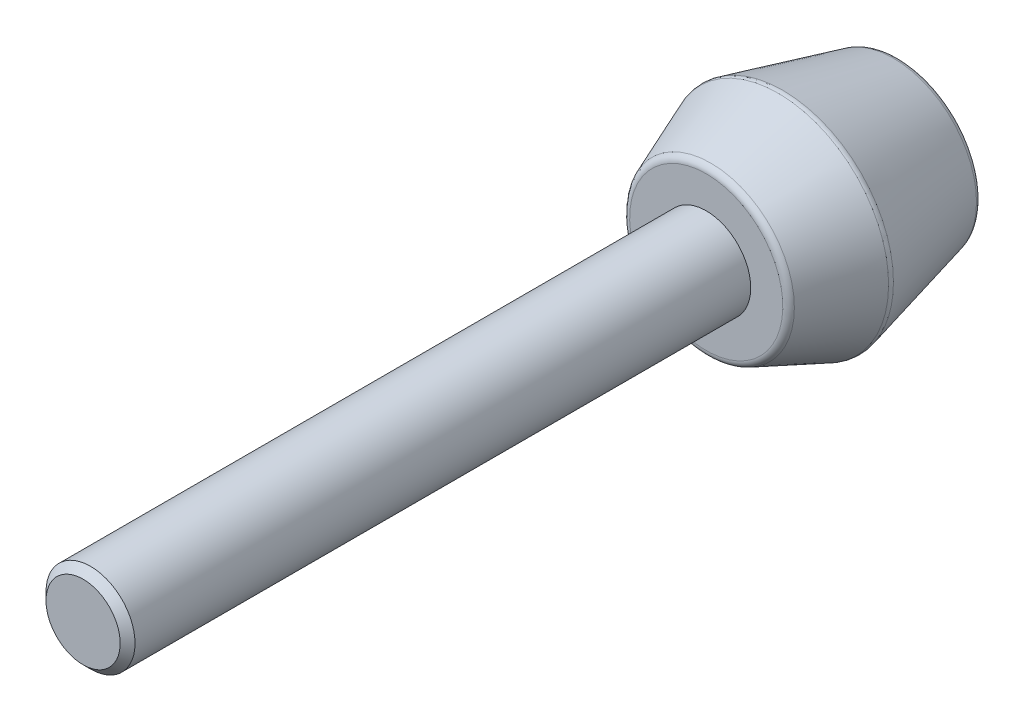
ISO-10303-21;
HEADER;
FILE_DESCRIPTION(('STEP AP214'),'2;1');
FILE_NAME('part.step','',(''),(''),'','','');
FILE_SCHEMA(('AUTOMOTIVE_DESIGN { 1 0 10303 214 1 1 1 1 }'));
ENDSEC;
DATA;
#1=APPLICATION_CONTEXT('core data for automotive mechanical design processes');
#2=APPLICATION_PROTOCOL_DEFINITION('international standard','automotive_design',2000,#1);
#3=PRODUCT_CONTEXT('',#1,'mechanical');
#4=PRODUCT('Part','Part','',(#3));
#5=PRODUCT_RELATED_PRODUCT_CATEGORY('part','',(#4));
#6=PRODUCT_DEFINITION_FORMATION('','',#4);
#7=PRODUCT_DEFINITION_CONTEXT('part definition',#1,'design');
#8=PRODUCT_DEFINITION('design','',#6,#7);
#9=PRODUCT_DEFINITION_SHAPE('','',#8);
#10=(LENGTH_UNIT() NAMED_UNIT(*) SI_UNIT(.MILLI.,.METRE.));
#11=(NAMED_UNIT(*) PLANE_ANGLE_UNIT() SI_UNIT($,.RADIAN.));
#12=(NAMED_UNIT(*) SI_UNIT($,.STERADIAN.) SOLID_ANGLE_UNIT());
#13=UNCERTAINTY_MEASURE_WITH_UNIT(LENGTH_MEASURE(1.E-05),#10,'distance_accuracy_value','');
#14=(GEOMETRIC_REPRESENTATION_CONTEXT(3) GLOBAL_UNCERTAINTY_ASSIGNED_CONTEXT((#13)) GLOBAL_UNIT_ASSIGNED_CONTEXT((#10,
#11,#12)) REPRESENTATION_CONTEXT('',''));
#15=CARTESIAN_POINT('',(0.,0.,0.));
#16=DIRECTION('',(0.,0.,1.));
#17=DIRECTION('',(1.,0.,0.));
#18=AXIS2_PLACEMENT_3D('',#15,#16,#17);
#19=CARTESIAN_POINT('',(0.,0.,0.));
#20=DIRECTION('',(0.,0.,-1.));
#21=DIRECTION('',(-1.,0.,0.));
#22=AXIS2_PLACEMENT_3D('',#19,#20,#21);
#23=PLANE('',#22);
#24=CARTESIAN_POINT('',(0.,0.,0.));
#25=DIRECTION('',(0.,0.,-1.));
#26=DIRECTION('',(-1.,0.,0.));
#27=AXIS2_PLACEMENT_3D('',#24,#25,#26);
#28=CIRCLE('',#27,5.10961179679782);
#29=CARTESIAN_POINT('',(-3.92983953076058,3.26565368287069,0.));
#30=VERTEX_POINT('',#29);
#31=CARTESIAN_POINT('',(3.9298395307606,-3.26565368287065,0.));
#32=VERTEX_POINT('',#31);
#33=EDGE_CURVE('E18',#30,#32,#28,.F.);
#34=ORIENTED_EDGE('',*,*,#33,.F.);
#35=CARTESIAN_POINT('',(3.9298395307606,-3.26565368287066,0.));
#36=CARTESIAN_POINT('',(3.96271365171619,-3.22607651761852,2.35537752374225E-12));
#37=CARTESIAN_POINT('',(3.99498994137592,-3.18600279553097,3.68134116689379E-10));
#38=CARTESIAN_POINT('',(4.05831812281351,-3.10489968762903,1.67353500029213E-09));
#39=CARTESIAN_POINT('',(4.08937002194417,-3.06387030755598,2.61315369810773E-09));
#40=CARTESIAN_POINT('',(4.15022091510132,-2.98089308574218,4.91320773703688E-09));
#41=CARTESIAN_POINT('',(4.180019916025,-2.93894524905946,6.27364076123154E-09));
#42=CARTESIAN_POINT('',(4.23833794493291,-2.8541693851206,9.27886281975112E-09));
#43=CARTESIAN_POINT('',(4.26685697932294,-2.81134136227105,1.09236504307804E-08));
#44=CARTESIAN_POINT('',(4.32258909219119,-2.72484413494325,1.43732504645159E-08));
#45=CARTESIAN_POINT('',(4.34980217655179,-2.68117493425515,1.6178062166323E-08));
#46=CARTESIAN_POINT('',(4.40289761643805,-2.59303514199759,1.98366967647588E-08));
#47=CARTESIAN_POINT('',(4.42877997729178,-2.54856455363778,2.16905194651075E-08));
#48=CARTESIAN_POINT('',(4.47919040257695,-2.45886250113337,2.53491622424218E-08));
#49=CARTESIAN_POINT('',(4.5037184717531,-2.4136310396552,2.71539824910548E-08));
#50=CARTESIAN_POINT('',(4.55139798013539,-2.32244844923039,3.06296909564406E-08));
#51=CARTESIAN_POINT('',(4.57454942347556,-2.27649732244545,3.23005795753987E-08));
#52=CARTESIAN_POINT('',(4.61945459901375,-2.18391726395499,3.54365577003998E-08));
#53=CARTESIAN_POINT('',(4.6412083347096,-2.13728833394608,3.69016477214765E-08));
#54=CARTESIAN_POINT('',(4.6832982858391,-2.0433951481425,3.95672290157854E-08));
#55=CARTESIAN_POINT('',(4.70363450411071,-1.99613089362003,4.07677208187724E-08));
#56=CARTESIAN_POINT('',(4.74287090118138,-1.90101011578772,4.28583728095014E-08));
#57=CARTESIAN_POINT('',(4.76177108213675,-1.85315359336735,4.37485334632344E-08));
#58=CARTESIAN_POINT('',(4.79811819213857,-1.75689187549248,4.51858567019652E-08));
#59=CARTESIAN_POINT('',(4.81556512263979,-1.70848668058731,4.57330196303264E-08));
#60=CARTESIAN_POINT('',(4.84898984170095,-1.61117171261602,4.64647478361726E-08));
#61=CARTESIAN_POINT('',(4.86496763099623,-1.56226193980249,4.66493132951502E-08));
#62=CARTESIAN_POINT('',(4.89543951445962,-1.46398236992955,4.66493133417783E-08));
#63=CARTESIAN_POINT('',(4.90993360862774,-1.41461257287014,4.64647479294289E-08));
#64=CARTESIAN_POINT('',(4.93742489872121,-1.31545792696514,4.57330197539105E-08));
#65=CARTESIAN_POINT('',(4.95042209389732,-1.2656730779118,4.5185856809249E-08));
#66=CARTESIAN_POINT('',(4.97490774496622,-1.16573367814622,4.3748533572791E-08));
#67=CARTESIAN_POINT('',(4.98639619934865,-1.11557912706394,4.2858372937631E-08));
#68=CARTESIAN_POINT('',(5.00785390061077,-1.01494600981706,4.07677209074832E-08));
#69=CARTESIAN_POINT('',(5.01782314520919,-0.964467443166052,3.95672290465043E-08));
#70=CARTESIAN_POINT('',(5.03623334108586,-0.863232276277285,3.69016479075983E-08));
#71=CARTESIAN_POINT('',(5.04467428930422,-0.812475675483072,3.54365580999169E-08));
#72=CARTESIAN_POINT('',(5.06002019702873,-0.710730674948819,3.23005793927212E-08));
#73=CARTESIAN_POINT('',(5.06692515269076,-0.659742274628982,3.06296899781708E-08));
#74=CARTESIAN_POINT('',(5.07919277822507,-0.557580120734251,2.71539836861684E-08));
#75=CARTESIAN_POINT('',(5.08455544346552,-0.506406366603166,2.53491664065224E-08));
#76=CARTESIAN_POINT('',(5.0937335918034,-0.403920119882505,2.16905155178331E-08));
#77=CARTESIAN_POINT('',(5.0975490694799,-0.352607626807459,1.98366817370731E-08));
#78=CARTESIAN_POINT('',(5.10362936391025,-0.249890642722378,1.61780771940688E-08));
#79=CARTESIAN_POINT('',(5.10589417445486,-0.198486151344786,1.43733066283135E-08));
#80=CARTESIAN_POINT('',(5.10887103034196,-0.0956319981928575,1.09235944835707E-08));
#81=CARTESIAN_POINT('',(5.10958306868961,-0.0441823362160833,9.27865362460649E-09));
#82=CARTESIAN_POINT('',(5.10945382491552,0.0587153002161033,6.27385017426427E-09));
#83=CARTESIAN_POINT('',(5.10861253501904,0.11016327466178,4.91398900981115E-09));
#84=CARTESIAN_POINT('',(5.1053769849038,0.213010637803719,2.612372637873E-09));
#85=CARTESIAN_POINT('',(5.10298271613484,0.26441002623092,1.67061973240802E-09));
#86=CARTESIAN_POINT('',(5.09664486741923,0.367113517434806,3.71049835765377E-10));
#87=CARTESIAN_POINT('',(5.09270127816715,0.418417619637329,1.3236351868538E-11));
#88=CARTESIAN_POINT('',(5.08325847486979,0.520930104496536,-1.32272578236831E-11));
#89=CARTESIAN_POINT('',(5.07775783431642,0.572138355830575,3.18756357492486E-10));
#90=CARTESIAN_POINT('',(5.06520196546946,0.674363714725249,5.87345769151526E-10));
#91=CARTESIAN_POINT('',(5.0581467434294,0.725380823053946,5.23953155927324E-10));
#92=CARTESIAN_POINT('',(5.04248972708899,0.827176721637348,1.69575433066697E-10));
#93=CARTESIAN_POINT('',(5.03388794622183,0.877955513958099,-1.21407699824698E-10));
#94=CARTESIAN_POINT('',(5.01514560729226,0.979227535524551,2.49117954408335E-10));
#95=CARTESIAN_POINT('',(5.00500506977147,1.02972076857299,9.10614027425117E-10));
#96=CARTESIAN_POINT('',(4.98319412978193,1.13037512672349,5.94561464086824E-09));
#97=CARTESIAN_POINT('',(4.97152375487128,1.18053625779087,1.03190523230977E-08));
#98=CARTESIAN_POINT('',(4.9466664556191,1.28047875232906,2.50898020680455E-08));
#99=CARTESIAN_POINT('',(4.93347956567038,1.33026012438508,3.54869775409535E-08));
#100=CARTESIAN_POINT('',(4.89961761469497,1.45064197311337,7.94713556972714E-08));
#101=CARTESIAN_POINT('',(4.87815501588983,1.52102371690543,1.21085945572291E-07));
#102=CARTESIAN_POINT('',(4.84602053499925,1.61883193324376,1.91165246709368E-07));
#103=CARTESIAN_POINT('',(4.83660605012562,1.6466794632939,2.12525625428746E-07));
#104=CARTESIAN_POINT('',(4.79319176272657,1.77161402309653,2.6845037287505E-07));
#105=CARTESIAN_POINT('',(4.75655245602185,1.86780485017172,2.02592038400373E-07));
#106=CARTESIAN_POINT('',(4.69469437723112,2.01716705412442,6.58482928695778E-08));
#107=CARTESIAN_POINT('',(4.67131018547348,2.0711087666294,9.21200799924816E-09));
#108=CARTESIAN_POINT('',(4.63968805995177,2.1404988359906,-2.15080641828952E-09));
#109=CARTESIAN_POINT('',(4.63235397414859,2.15636009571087,-5.23429723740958E-10));
#110=CARTESIAN_POINT('',(4.5813574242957,2.26512198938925,7.83807498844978E-09));
#111=CARTESIAN_POINT('',(4.53485630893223,2.35671831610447,8.03291034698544E-10));
#112=CARTESIAN_POINT('',(4.45186327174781,2.50872263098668,-5.1927746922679E-10));
#113=CARTESIAN_POINT('',(4.416794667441,2.56991824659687,1.89208759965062E-09));
#114=CARTESIAN_POINT('',(4.3501782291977,2.68077077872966,9.67465717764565E-09));
#115=CARTESIAN_POINT('',(4.31901234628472,2.7306567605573,1.44880583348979E-08));
#116=CARTESIAN_POINT('',(4.25898615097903,2.82315918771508,2.38089493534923E-08));
#117=CARTESIAN_POINT('',(4.23032460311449,2.86590486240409,2.82794697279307E-08));
#118=CARTESIAN_POINT('',(4.17172609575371,2.95051289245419,3.65504858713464E-08));
#119=CARTESIAN_POINT('',(4.14178914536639,2.9923752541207,4.03509864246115E-08));
#120=CARTESIAN_POINT('',(4.08066777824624,3.07517872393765,4.65743599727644E-08));
#121=CARTESIAN_POINT('',(4.04948336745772,3.1161198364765,4.8997239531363E-08));
#122=CARTESIAN_POINT('',(3.98589511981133,3.1970437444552,5.20750425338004E-08));
#123=CARTESIAN_POINT('',(3.95349128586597,3.23702654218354,5.27299702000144E-08));
#124=CARTESIAN_POINT('',(3.88749360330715,3.31599760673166,5.21683787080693E-08));
#125=CARTESIAN_POINT('',(3.85389975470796,3.35498587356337,5.09518595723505E-08));
#126=CARTESIAN_POINT('',(3.7855524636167,3.43193257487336,4.68391051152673E-08));
#127=CARTESIAN_POINT('',(3.75079901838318,3.46989100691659,4.39428658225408E-08));
#128=CARTESIAN_POINT('',(3.68016397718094,3.54474361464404,3.69545109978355E-08));
#129=CARTESIAN_POINT('',(3.6442823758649,3.58163778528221,3.28623897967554E-08));
#130=CARTESIAN_POINT('',(3.5714236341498,3.65432859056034,2.42622741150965E-08));
#131=CARTESIAN_POINT('',(3.53444648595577,3.69012521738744,1.97542766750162E-08));
#132=CARTESIAN_POINT('',(3.45942966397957,3.76058795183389,1.1385458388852E-08));
#133=CARTESIAN_POINT('',(3.42138998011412,3.79525404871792,7.52464368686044E-09));
#134=CARTESIAN_POINT('',(3.34428424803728,3.86342634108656,1.84468683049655E-09));
#135=CARTESIAN_POINT('',(3.30521818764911,3.89693252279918,2.55689096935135E-11));
#136=CARTESIAN_POINT('',(3.22606100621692,3.96276997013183,-2.55662919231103E-11));
#137=CARTESIAN_POINT('',(3.18596917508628,3.99510038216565,1.74497154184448E-09));
#138=CARTESIAN_POINT('',(3.10481816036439,4.05852341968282,4.75745464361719E-09));
#139=CARTESIAN_POINT('',(3.06375897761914,4.08961604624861,5.99940037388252E-09));
#140=CARTESIAN_POINT('',(2.98071328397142,4.15053650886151,6.47409573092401E-09));
#141=CARTESIAN_POINT('',(2.93872678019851,4.18036435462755,5.70686079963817E-09));
#142=CARTESIAN_POINT('',(2.85386545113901,4.23872694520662,2.96854866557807E-09));
#143=CARTESIAN_POINT('',(2.81099063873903,4.26726170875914,9.97488914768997E-10));
#144=CARTESIAN_POINT('',(2.72439219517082,4.32301131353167,-3.72037772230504E-10));
#145=CARTESIAN_POINT('',(2.68066858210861,4.35022618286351,2.29440475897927E-10));
#146=CARTESIAN_POINT('',(2.59241611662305,4.40331188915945,8.36659364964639E-09));
#147=CARTESIAN_POINT('',(2.547887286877,4.42918276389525,1.5902073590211E-08));
#148=CARTESIAN_POINT('',(2.43880988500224,4.49034291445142,5.93847922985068E-08));
#149=CARTESIAN_POINT('',(2.37385801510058,4.52491838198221,1.06121802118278E-07));
#150=CARTESIAN_POINT('',(2.28196340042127,4.57133497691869,1.9714607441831E-07));
#151=CARTESIAN_POINT('',(2.25561169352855,4.58436303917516,2.26059278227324E-07));
#152=CARTESIAN_POINT('',(2.13655930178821,4.64198235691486,3.08030373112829E-07));
#153=CARTESIAN_POINT('',(2.04263184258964,4.68408315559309,2.40839121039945E-07));
#154=CARTESIAN_POINT('',(1.89328763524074,4.74598200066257,8.05492123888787E-08));
#155=CARTESIAN_POINT('',(1.83861740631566,4.76760585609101,1.08932445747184E-08));
#156=CARTESIAN_POINT('',(1.76781275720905,4.79408616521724,-2.53335771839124E-09));
#157=CARTESIAN_POINT('',(1.7520323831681,4.7998915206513,-6.74416015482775E-10));
#158=CARTESIAN_POINT('',(1.63970442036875,4.8405604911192,9.33485939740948E-09));
#159=CARTESIAN_POINT('',(1.54206630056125,4.87248301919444,1.161027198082E-09));
#160=CARTESIAN_POINT('',(1.37528271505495,4.92153089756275,-7.82896983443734E-10));
#161=CARTESIAN_POINT('',(1.30657957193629,4.94019225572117,1.79924165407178E-09));
#162=CARTESIAN_POINT('',(1.18044932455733,4.97163181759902,9.71853858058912E-09));
#163=CARTESIAN_POINT('',(1.12313700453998,4.98486885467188,1.44990852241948E-08));
#164=CARTESIAN_POINT('',(1.01528298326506,5.00783297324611,2.37993008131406E-08));
#165=CARTESIAN_POINT('',(0.964790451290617,5.0177919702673,2.82768844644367E-08));
#166=CARTESIAN_POINT('',(0.863528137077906,5.03618349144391,3.6553072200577E-08));
#167=CARTESIAN_POINT('',(0.812758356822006,5.04461602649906,4.03516811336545E-08));
#168=CARTESIAN_POINT('',(0.710988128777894,5.05994758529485,4.657366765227E-08));
#169=CARTESIAN_POINT('',(0.659987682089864,5.06684661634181,4.89970517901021E-08));
#170=CARTESIAN_POINT('',(0.557802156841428,5.079104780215,5.20752333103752E-08));
#171=CARTESIAN_POINT('',(0.506617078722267,5.08446391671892,5.27300349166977E-08));
#172=CARTESIAN_POINT('',(0.404108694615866,5.09363748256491,5.21683174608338E-08));
#173=CARTESIAN_POINT('',(0.352785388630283,5.0974519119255,5.09517984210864E-08));
#174=CARTESIAN_POINT('',(0.250047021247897,5.10353261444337,4.68391693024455E-08));
#175=CARTESIAN_POINT('',(0.198631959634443,5.1057988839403,4.39430552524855E-08));
#176=CARTESIAN_POINT('',(0.0957566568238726,5.10878114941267,3.6954323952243E-08));
#177=CARTESIAN_POINT('',(0.0442964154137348,5.10949713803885,3.28617010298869E-08));
#178=CARTESIAN_POINT('',(-0.058622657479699,5.10937840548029,2.42629644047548E-08));
#179=CARTESIAN_POINT('',(-0.110081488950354,5.10854367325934,1.97568477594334E-08));
#180=CARTESIAN_POINT('',(-0.212951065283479,5.10532338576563,1.13828877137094E-08));
#181=CARTESIAN_POINT('',(-0.264361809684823,5.10293781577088,7.51505037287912E-09));
#182=CARTESIAN_POINT('',(-0.367088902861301,5.09662114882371,1.85427982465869E-09));
#183=CARTESIAN_POINT('',(-0.418405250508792,5.09269003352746,6.13712452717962E-11));
#184=CARTESIAN_POINT('',(-0.520887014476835,5.08327482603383,-6.13412747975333E-11));
#185=CARTESIAN_POINT('',(-0.572052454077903,5.07779098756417,1.60828925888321E-09));
#186=CARTESIAN_POINT('',(-0.674191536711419,5.06526310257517,3.87066400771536E-09));
#187=CARTESIAN_POINT('',(-0.725165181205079,5.05821906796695,4.46341644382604E-09));
#188=CARTESIAN_POINT('',(-0.826873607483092,5.04258163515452,2.82944585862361E-09));
#189=CARTESIAN_POINT('',(-0.877608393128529,5.03398826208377,6.02768570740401E-10));
#190=CARTESIAN_POINT('',(-0.978789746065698,5.0152556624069,5.62419884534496E-10));
#191=CARTESIAN_POINT('',(-1.02923632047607,5.00511647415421,2.74863901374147E-09));
#192=CARTESIAN_POINT('',(-1.14236876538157,4.98059153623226,3.72296394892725E-09));
#193=CARTESIAN_POINT('',(-1.20496252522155,4.96577778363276,1.52524049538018E-09));
#194=CARTESIAN_POINT('',(-1.32951824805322,4.93371568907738,9.47223061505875E-08));
#195=CARTESIAN_POINT('',(-1.39148024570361,4.91646748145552,1.9011171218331E-07));
#196=CARTESIAN_POINT('',(-1.49240301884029,4.88649085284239,2.12684619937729E-07));
#197=CARTESIAN_POINT('',(-1.53155292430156,4.87439294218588,1.88337872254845E-07));
#198=CARTESIAN_POINT('',(-1.62074553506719,4.84564619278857,1.38602639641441E-07));
#199=CARTESIAN_POINT('',(-1.67068894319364,4.82868789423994,1.14921478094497E-07));
#200=CARTESIAN_POINT('',(-1.79004333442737,4.78609893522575,6.28710859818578E-08));
#201=CARTESIAN_POINT('',(-1.85919123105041,4.75972683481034,3.64566993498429E-08));
#202=CARTESIAN_POINT('',(-1.98313292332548,4.70933465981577,8.83351110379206E-09));
#203=CARTESIAN_POINT('',(-2.03813811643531,4.68583232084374,3.76452166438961E-09));
#204=CARTESIAN_POINT('',(-2.14525283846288,4.63780131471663,-5.74745807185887E-10));
#205=CARTESIAN_POINT('',(-2.19739399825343,4.61334327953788,-5.35826590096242E-11));
#206=CARTESIAN_POINT('',(-2.29338669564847,4.56629655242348,1.55458514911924E-10));
#207=CARTESIAN_POINT('',(-2.33735391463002,4.54394339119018,-4.7800982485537E-11));
#208=CARTESIAN_POINT('',(-2.42669780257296,4.49687183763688,5.00974894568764E-11));
#209=CARTESIAN_POINT('',(-2.47204185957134,4.47209150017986,3.7574184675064E-10));
#210=CARTESIAN_POINT('',(-2.56192766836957,4.42118875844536,1.48825062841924E-09));
#211=CARTESIAN_POINT('',(-2.60646996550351,4.39506731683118,2.27478832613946E-09));
#212=CARTESIAN_POINT('',(-2.69471172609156,4.34150612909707,3.99096848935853E-09));
#213=CARTESIAN_POINT('',(-2.73841176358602,4.31406732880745,4.92050930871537E-09));
#214=CARTESIAN_POINT('',(-2.82493114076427,4.25790015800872,6.73116380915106E-09));
#215=CARTESIAN_POINT('',(-2.86775108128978,4.22917271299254,7.61231126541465E-09));
#216=CARTESIAN_POINT('',(-2.95247287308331,4.17045703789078,9.1664622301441E-09));
#217=CARTESIAN_POINT('',(-2.99437535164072,4.14046971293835,9.8396123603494E-09));
#218=CARTESIAN_POINT('',(-3.07722592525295,4.07926439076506,1.08752307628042E-08));
#219=CARTESIAN_POINT('',(-3.11817467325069,4.04804727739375,1.12379180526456E-08));
#220=CARTESIAN_POINT('',(-3.19908245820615,3.98441343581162,1.16004695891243E-08));
#221=CARTESIAN_POINT('',(-3.23904217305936,3.95199756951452,1.16005896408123E-08));
#222=CARTESIAN_POINT('',(-3.31793760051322,3.88599828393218,1.12380537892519E-08));
#223=CARTESIAN_POINT('',(-3.35687401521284,3.85241570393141,1.0875653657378E-08));
#224=CARTESIAN_POINT('',(-3.43368960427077,3.78411599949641,9.83991995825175E-09));
#225=CARTESIAN_POINT('',(-3.47156950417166,3.74939969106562,9.16680563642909E-09));
#226=CARTESIAN_POINT('',(-3.54623990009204,3.67886645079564,7.61306401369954E-09));
#227=CARTESIAN_POINT('',(-3.58303114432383,3.64305031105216,6.73258314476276E-09));
#228=CARTESIAN_POINT('',(-3.65549318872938,3.57035222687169,4.92036779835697E-09));
#229=CARTESIAN_POINT('',(-3.69116475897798,3.53347105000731,3.98866981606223E-09));
#230=CARTESIAN_POINT('',(-3.76135746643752,3.45867848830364,2.27829558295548E-09));
#231=CARTESIAN_POINT('',(-3.79587939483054,3.42076784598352,1.4995122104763E-09));
#232=CARTESIAN_POINT('',(-3.86374425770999,3.34395300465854,3.65272612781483E-10));
#233=CARTESIAN_POINT('',(-3.89708800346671,3.30504952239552,9.51936072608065E-12));
#234=CARTESIAN_POINT('',(-3.9298395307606,3.26565368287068,0.));
#235=B_SPLINE_CURVE_WITH_KNOTS('',3,(#35,#36,#37,#38,#39,#40,#41,#42,#43,#44,#45,#46,#47,#48,
#49,#50,#51,#52,#53,#54,#55,#56,#57,#58,#59,#60,#61,#62,#63,#64,#65,#66,#67,#68,#69,#70,#71,#72,
#73,#74,#75,#76,#77,#78,#79,#80,#81,#82,#83,#84,#85,#86,#87,#88,#89,#90,#91,#92,#93,#94,#95,#96,
#97,#98,#99,#100,#101,#102,#103,#104,#105,#106,#107,#108,#109,#110,#111,#112,#113,#114,#115,
#116,#117,#118,#119,#120,#121,#122,#123,#124,#125,#126,#127,#128,#129,#130,#131,#132,#133,#134,
#135,#136,#137,#138,#139,#140,#141,#142,#143,#144,#145,#146,#147,#148,#149,#150,#151,#152,#153,
#154,#155,#156,#157,#158,#159,#160,#161,#162,#163,#164,#165,#166,#167,#168,#169,#170,#171,#172,
#173,#174,#175,#176,#177,#178,#179,#180,#181,#182,#183,#184,#185,#186,#187,#188,#189,#190,#191,
#192,#193,#194,#195,#196,#197,#198,#199,#200,#201,#202,#203,#204,#205,#206,#207,#208,#209,#210,
#211,#212,#213,#214,#215,#216,#217,#218,#219,#220,#221,#222,#223,#224,#225,#226,#227,#228,#229,
#230,#231,#232,#233,#234),.UNSPECIFIED.,.F.,.F.,(4,2,2,2,2,2,2,2,2,2,2,2,2,2,2,2,2,2,2,2,2,2,2,
2,2,2,2,2,2,2,2,2,2,2,2,2,2,2,2,2,2,2,2,2,2,2,2,2,2,2,2,2,2,2,2,2,2,2,2,2,2,2,2,2,2,2,2,2,2,2,2,
2,2,2,2,2,2,2,2,2,2,2,2,2,2,2,2,2,2,2,2,2,2,2,2,2,2,2,2,4),(0.,0.154342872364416,
0.308684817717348,0.463025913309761,0.617366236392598,0.771705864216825,0.92604487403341,
1.0803833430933,1.23472134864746,1.38905896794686,1.54339627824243,1.69773335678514,
1.85207028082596,2.00640712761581,2.16074397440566,2.31508089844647,2.46941797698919,
2.62375528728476,2.77809290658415,2.93243091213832,3.08676938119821,3.24110839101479,
3.39544801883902,3.54978834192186,3.70412943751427,3.8584713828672,4.01281425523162,
4.16729899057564,4.32178310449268,4.47626587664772,4.63074658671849,4.78522451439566,
4.93969893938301,5.16036034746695,5.24854692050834,5.55713425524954,5.73347872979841,
5.78590288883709,6.09383976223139,6.30538389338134,6.48181043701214,6.6361838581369,
6.79055617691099,6.94492776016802,7.0992989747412,7.25367018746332,7.40804176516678,
7.56241407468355,7.7167874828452,7.87116235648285,8.02553906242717,8.1800256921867,
8.33451218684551,8.48899749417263,8.64348056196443,8.79796033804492,8.95243577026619,
9.17309645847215,9.26128430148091,9.56987094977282,9.74621258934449,9.79665544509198,
10.1045923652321,10.3181174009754,10.4945439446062,10.6489173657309,10.803289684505,
10.9576612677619,11.112032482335,11.2664036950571,11.4207752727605,11.5751475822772,
11.7295209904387,11.8838958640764,12.0382725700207,12.1926240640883,12.3469743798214,
12.5013221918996,12.6556661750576,12.8485845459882,13.0414922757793,13.1644127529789,
13.3226198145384,13.5445634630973,13.7239755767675,13.8967181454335,14.0446676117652,
14.1996638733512,14.3545503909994,14.5093273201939,14.6639948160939,14.8185530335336,
14.9730021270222,15.127342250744,15.2815735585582,15.4356962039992,15.5897103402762,
15.7436161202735,15.8974136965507,16.051103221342),.UNSPECIFIED.);
#236=EDGE_CURVE('E30',#32,#30,#235,.T.);
#237=ORIENTED_EDGE('',*,*,#236,.F.);
#238=EDGE_LOOP('',(#34,#237));
#239=FACE_BOUND('',#238,.T.);
#240=ADVANCED_FACE('F14',(#239),#23,.T.);
#241=CARTESIAN_POINT('',(0.,0.,0.500000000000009));
#242=DIRECTION('',(0.,0.,-1.));
#243=DIRECTION('',(-1.,0.,0.));
#244=AXIS2_PLACEMENT_3D('',#241,#242,#243);
#245=TOROIDAL_SURFACE('',#244,5.10961179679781,0.5);
#246=ORIENTED_EDGE('',*,*,#236,.T.);
#247=ORIENTED_EDGE('',*,*,#33,.T.);
#248=EDGE_LOOP('',(#246,#247));
#249=FACE_BOUND('',#248,.T.);
#250=CARTESIAN_POINT('',(0.,0.,0.378732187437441));
#251=DIRECTION('',(0.,0.,1.));
#252=DIRECTION('',(-0.7691072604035,0.639119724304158,0.));
#253=AXIS2_PLACEMENT_3D('',#250,#251,#252);
#254=CIRCLE('',#253,5.5946830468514);
#255=CARTESIAN_POINT('',(-4.30291135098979,3.57567228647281,0.37873218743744));
#256=VERTEX_POINT('',#255);
#257=EDGE_CURVE('E36',#256,#256,#254,.T.);
#258=ORIENTED_EDGE('',*,*,#257,.F.);
#259=EDGE_LOOP('',(#258));
#260=FACE_BOUND('',#259,.T.);
#261=ADVANCED_FACE('F33',(#249,#260),#245,.T.);
#262=CARTESIAN_POINT('',(0.,0.,7.84315022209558));
#263=DIRECTION('',(0.,0.,1.));
#264=DIRECTION('',(1.,0.,0.));
#265=AXIS2_PLACEMENT_3D('',#262,#263,#264);
#266=CONICAL_SURFACE('',#265,7.46078755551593,0.244978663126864);
#267=CARTESIAN_POINT('',(0.,0.,7.84315022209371));
#268=DIRECTION('',(0.,0.,1.));
#269=DIRECTION('',(1.,0.,0.));
#270=AXIS2_PLACEMENT_3D('',#267,#268,#269);
#271=CIRCLE('',#270,7.46078755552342);
#272=CARTESIAN_POINT('',(7.46078755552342,0.,7.84315022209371));
#273=VERTEX_POINT('',#272);
#274=EDGE_CURVE('E38',#273,#273,#271,.T.);
#275=ORIENTED_EDGE('',*,*,#274,.F.);
#276=EDGE_LOOP('',(#275));
#277=FACE_BOUND('',#276,.T.);
#278=ORIENTED_EDGE('',*,*,#257,.T.);
#279=EDGE_LOOP('',(#278));
#280=FACE_BOUND('',#279,.T.);
#281=ADVANCED_FACE('F60',(#277,#280),#266,.T.);
#282=CARTESIAN_POINT('',(0.,0.,7.96441803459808));
#283=DIRECTION('',(0.,0.,-1.));
#284=DIRECTION('',(-1.,0.,0.));
#285=AXIS2_PLACEMENT_3D('',#282,#283,#284);
#286=TOROIDAL_SURFACE('',#285,6.97571630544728,0.500000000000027);
#287=ORIENTED_EDGE('',*,*,#274,.T.);
#288=EDGE_LOOP('',(#287));
#289=FACE_BOUND('',#288,.T.);
#290=CARTESIAN_POINT('',(0.,0.,8.15011337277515));
#291=DIRECTION('',(0.,0.,-1.));
#292=DIRECTION('',(0.7691072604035,-0.639119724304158,0.));
#293=AXIS2_PLACEMENT_3D('',#290,#291,#292);
#294=CIRCLE('',#293,7.43995465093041);
#295=CARTESIAN_POINT('',(5.72212313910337,-4.75502176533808,8.15011337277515));
#296=VERTEX_POINT('',#295);
#297=EDGE_CURVE('E43',#296,#296,#294,.F.);
#298=ORIENTED_EDGE('',*,*,#297,.F.);
#299=EDGE_LOOP('',(#298));
#300=FACE_BOUND('',#299,.T.);
#301=ADVANCED_FACE('F61',(#289,#300),#286,.T.);
#302=CARTESIAN_POINT('',(0.,0.,8.15011337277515));
#303=DIRECTION('',(0.,0.,-1.));
#304=DIRECTION('',(-1.,0.,0.));
#305=AXIS2_PLACEMENT_3D('',#302,#303,#304);
#306=CONICAL_SURFACE('',#305,7.43995465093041,0.380506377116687);
#307=ORIENTED_EDGE('',*,*,#297,.T.);
#308=EDGE_LOOP('',(#307));
#309=FACE_BOUND('',#308,.T.);
#310=CARTESIAN_POINT('',(0.,0.,12.6856953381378));
#311=DIRECTION('',(0.,0.,1.));
#312=DIRECTION('',(0.,-1.,0.));
#313=AXIS2_PLACEMENT_3D('',#310,#311,#312);
#314=CIRCLE('',#313,5.62572186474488);
#315=CARTESIAN_POINT('',(0.,-5.62572186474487,12.6856953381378));
#316=VERTEX_POINT('',#315);
#317=EDGE_CURVE('E106',#316,#316,#314,.T.);
#318=ORIENTED_EDGE('',*,*,#317,.F.);
#319=EDGE_LOOP('',(#318));
#320=FACE_BOUND('',#319,.T.);
#321=ADVANCED_FACE('F63',(#309,#320),#306,.T.);
#322=CARTESIAN_POINT('',(0.,0.,12.5));
#323=DIRECTION('',(0.,0.,-1.));
#324=DIRECTION('',(0.,1.,0.));
#325=AXIS2_PLACEMENT_3D('',#322,#323,#324);
#326=TOROIDAL_SURFACE('',#325,5.16148351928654,0.5);
#327=ORIENTED_EDGE('',*,*,#317,.T.);
#328=EDGE_LOOP('',(#327));
#329=FACE_BOUND('',#328,.T.);
#330=CARTESIAN_POINT('',(0.,0.,13.));
#331=DIRECTION('',(0.,0.,-1.));
#332=DIRECTION('',(0.,1.,0.));
#333=AXIS2_PLACEMENT_3D('',#330,#331,#332);
#334=CIRCLE('',#333,5.16148351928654);
#335=CARTESIAN_POINT('',(0.,5.16148351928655,13.));
#336=VERTEX_POINT('',#335);
#337=EDGE_CURVE('E104',#336,#336,#334,.T.);
#338=ORIENTED_EDGE('',*,*,#337,.T.);
#339=EDGE_LOOP('',(#338));
#340=FACE_BOUND('',#339,.T.);
#341=ADVANCED_FACE('F16',(#329,#340),#326,.T.);
#342=CARTESIAN_POINT('',(0.,0.,55.));
#343=DIRECTION('',(0.,0.,1.));
#344=DIRECTION('',(1.,0.,0.));
#345=AXIS2_PLACEMENT_3D('',#342,#343,#344);
#346=PLANE('',#345);
#347=CARTESIAN_POINT('',(0.,0.,55.0000000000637));
#348=DIRECTION('',(0.,0.,-1.));
#349=DIRECTION('',(-1.,0.,0.));
#350=AXIS2_PLACEMENT_3D('',#347,#348,#349);
#351=CIRCLE('',#350,2.49999999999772);
#352=CARTESIAN_POINT('',(-2.49999999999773,0.,55.0000000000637));
#353=VERTEX_POINT('',#352);
#354=EDGE_CURVE('E103',#353,#353,#351,.T.);
#355=ORIENTED_EDGE('',*,*,#354,.F.);
#356=EDGE_LOOP('',(#355));
#357=FACE_BOUND('',#356,.T.);
#358=ADVANCED_FACE('F92',(#357),#346,.T.);
#359=CARTESIAN_POINT('',(7.8237338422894,9.41496604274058,13.));
#360=DIRECTION('',(0.,0.,-1.));
#361=DIRECTION('',(-1.,0.,0.));
#362=AXIS2_PLACEMENT_3D('',#359,#360,#361);
#363=PLANE('',#362);
#364=ORIENTED_EDGE('',*,*,#337,.F.);
#365=EDGE_LOOP('',(#364));
#366=FACE_BOUND('',#365,.T.);
#367=CARTESIAN_POINT('',(0.,0.,13.));
#368=DIRECTION('',(0.,0.,1.));
#369=DIRECTION('',(1.,0.,0.));
#370=AXIS2_PLACEMENT_3D('',#367,#368,#369);
#371=CIRCLE('',#370,3.);
#372=CARTESIAN_POINT('',(3.,0.,13.));
#373=VERTEX_POINT('',#372);
#374=EDGE_CURVE('E24',#373,#373,#371,.T.);
#375=ORIENTED_EDGE('',*,*,#374,.F.);
#376=EDGE_LOOP('',(#375));
#377=FACE_BOUND('',#376,.T.);
#378=ADVANCED_FACE('F84',(#366,#377),#363,.F.);
#379=CARTESIAN_POINT('',(0.,0.,54.5000000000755));
#380=DIRECTION('',(0.,0.,-1.));
#381=DIRECTION('',(-1.,0.,0.));
#382=AXIS2_PLACEMENT_3D('',#379,#380,#381);
#383=CONICAL_SURFACE('',#382,3.00000000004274,0.785398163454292);
#384=ORIENTED_EDGE('',*,*,#354,.T.);
#385=EDGE_LOOP('',(#384));
#386=FACE_BOUND('',#385,.T.);
#387=CARTESIAN_POINT('',(0.,0.,54.5));
#388=DIRECTION('',(0.,0.,1.));
#389=DIRECTION('',(1.,0.,0.));
#390=AXIS2_PLACEMENT_3D('',#387,#388,#389);
#391=CIRCLE('',#390,3.);
#392=CARTESIAN_POINT('',(2.99999999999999,0.,54.5));
#393=VERTEX_POINT('',#392);
#394=EDGE_CURVE('E9',#393,#393,#391,.F.);
#395=ORIENTED_EDGE('',*,*,#394,.F.);
#396=EDGE_LOOP('',(#395));
#397=FACE_BOUND('',#396,.T.);
#398=ADVANCED_FACE('F77',(#386,#397),#383,.T.);
#399=CARTESIAN_POINT('',(0.,0.,2.5));
#400=DIRECTION('',(0.,0.,1.));
#401=DIRECTION('',(1.,0.,0.));
#402=AXIS2_PLACEMENT_3D('',#399,#400,#401);
#403=CYLINDRICAL_SURFACE('',#402,3.);
#404=ORIENTED_EDGE('',*,*,#374,.T.);
#405=EDGE_LOOP('',(#404));
#406=FACE_BOUND('',#405,.T.);
#407=ORIENTED_EDGE('',*,*,#394,.T.);
#408=EDGE_LOOP('',(#407));
#409=FACE_BOUND('',#408,.T.);
#410=ADVANCED_FACE('F75',(#406,#409),#403,.T.);
#411=CLOSED_SHELL('',(#240,#261,#281,#301,#321,#341,#358,#378,#398,#410));
#412=MANIFOLD_SOLID_BREP('B1',#411);
#413=ADVANCED_BREP_SHAPE_REPRESENTATION('',(#18,#412),#14);
#414=SHAPE_DEFINITION_REPRESENTATION(#9,#413);
ENDSEC;
END-ISO-10303-21;
